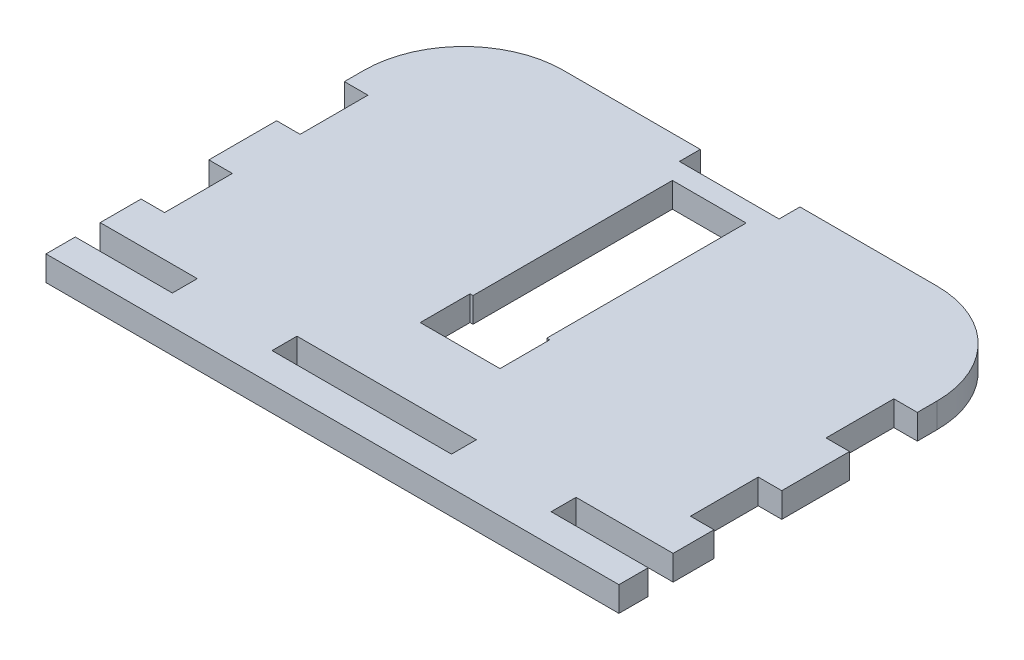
ISO-10303-21;
HEADER;
FILE_DESCRIPTION(('STEP AP214'),'2;1');
FILE_NAME('part.step','',(''),(''),'','','');
FILE_SCHEMA(('AUTOMOTIVE_DESIGN { 1 0 10303 214 1 1 1 1 }'));
ENDSEC;
DATA;
#1=APPLICATION_CONTEXT('core data for automotive mechanical design processes');
#2=APPLICATION_PROTOCOL_DEFINITION('international standard','automotive_design',2000,#1);
#3=PRODUCT_CONTEXT('',#1,'mechanical');
#4=PRODUCT('Part','Part','',(#3));
#5=PRODUCT_RELATED_PRODUCT_CATEGORY('part','',(#4));
#6=PRODUCT_DEFINITION_FORMATION('','',#4);
#7=PRODUCT_DEFINITION_CONTEXT('part definition',#1,'design');
#8=PRODUCT_DEFINITION('design','',#6,#7);
#9=PRODUCT_DEFINITION_SHAPE('','',#8);
#10=(LENGTH_UNIT() NAMED_UNIT(*) SI_UNIT(.MILLI.,.METRE.));
#11=(NAMED_UNIT(*) PLANE_ANGLE_UNIT() SI_UNIT($,.RADIAN.));
#12=(NAMED_UNIT(*) SI_UNIT($,.STERADIAN.) SOLID_ANGLE_UNIT());
#13=UNCERTAINTY_MEASURE_WITH_UNIT(LENGTH_MEASURE(1.E-05),#10,'distance_accuracy_value','');
#14=(GEOMETRIC_REPRESENTATION_CONTEXT(3) GLOBAL_UNCERTAINTY_ASSIGNED_CONTEXT((#13)) GLOBAL_UNIT_ASSIGNED_CONTEXT((#10,
#11,#12)) REPRESENTATION_CONTEXT('',''));
#15=CARTESIAN_POINT('',(0.,0.,0.));
#16=DIRECTION('',(0.,0.,1.));
#17=DIRECTION('',(1.,0.,0.));
#18=AXIS2_PLACEMENT_3D('',#15,#16,#17);
#19=CARTESIAN_POINT('',(23.8,3.175,-21.7846381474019));
#20=DIRECTION('',(0.,-1.,0.));
#21=DIRECTION('',(0.,0.,-1.));
#22=AXIS2_PLACEMENT_3D('',#19,#20,#21);
#23=PLANE('',#22);
#24=DIRECTION('',(0.,0.,-1.));
#25=VECTOR('',#24,1.);
#26=CARTESIAN_POINT('',(4.69899999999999,3.175,-29.2810115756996));
#27=LINE('',#26,#25);
#28=CARTESIAN_POINT('',(4.69899999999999,3.175,-3.87742834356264));
#29=VERTEX_POINT('',#28);
#30=CARTESIAN_POINT('',(4.69899999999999,3.175,-29.2810115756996));
#31=VERTEX_POINT('',#30);
#32=EDGE_CURVE('E406',#29,#31,#27,.T.);
#33=ORIENTED_EDGE('',*,*,#32,.F.);
#34=DIRECTION('',(-1.,0.,0.));
#35=VECTOR('',#34,1.);
#36=CARTESIAN_POINT('',(5.08,3.175,-3.87742834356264));
#37=LINE('',#36,#35);
#38=CARTESIAN_POINT('',(5.08,3.175,-3.87742834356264));
#39=VERTEX_POINT('',#38);
#40=EDGE_CURVE('E355',#39,#29,#37,.T.);
#41=ORIENTED_EDGE('',*,*,#40,.F.);
#42=DIRECTION('',(0.,0.,-1.));
#43=VECTOR('',#42,1.);
#44=CARTESIAN_POINT('',(5.08,3.175,2.46898842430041));
#45=LINE('',#44,#43);
#46=CARTESIAN_POINT('',(5.08,3.175,2.46898842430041));
#47=VERTEX_POINT('',#46);
#48=EDGE_CURVE('E363',#47,#39,#45,.T.);
#49=ORIENTED_EDGE('',*,*,#48,.F.);
#50=DIRECTION('',(1.,0.,0.));
#51=VECTOR('',#50,1.);
#52=CARTESIAN_POINT('',(-4.69900000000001,3.175,2.46898842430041));
#53=LINE('',#52,#51);
#54=CARTESIAN_POINT('',(-5.08,3.175,2.46898842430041));
#55=VERTEX_POINT('',#54);
#56=EDGE_CURVE('E404',#55,#47,#53,.T.);
#57=ORIENTED_EDGE('',*,*,#56,.F.);
#58=DIRECTION('',(0.,0.,1.));
#59=VECTOR('',#58,1.);
#60=CARTESIAN_POINT('',(-5.08,3.175,2.46898842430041));
#61=LINE('',#60,#59);
#62=CARTESIAN_POINT('',(-5.08,3.175,-3.87742834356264));
#63=VERTEX_POINT('',#62);
#64=EDGE_CURVE('E346',#63,#55,#61,.T.);
#65=ORIENTED_EDGE('',*,*,#64,.F.);
#66=CARTESIAN_POINT('',(-4.69900000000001,3.175,-3.87742834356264));
#67=VERTEX_POINT('',#66);
#68=EDGE_CURVE('E358',#67,#63,#37,.T.);
#69=ORIENTED_EDGE('',*,*,#68,.F.);
#70=DIRECTION('',(0.,0.,1.));
#71=VECTOR('',#70,1.);
#72=CARTESIAN_POINT('',(-4.69900000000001,3.175,-29.2810115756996));
#73=LINE('',#72,#71);
#74=CARTESIAN_POINT('',(-4.69900000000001,3.175,-29.2810115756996));
#75=VERTEX_POINT('',#74);
#76=EDGE_CURVE('E401',#75,#67,#73,.T.);
#77=ORIENTED_EDGE('',*,*,#76,.F.);
#78=DIRECTION('',(-1.,0.,0.));
#79=VECTOR('',#78,1.);
#80=CARTESIAN_POINT('',(0.,3.175,-29.2810115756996));
#81=LINE('',#80,#79);
#82=EDGE_CURVE('E399',#31,#75,#81,.T.);
#83=ORIENTED_EDGE('',*,*,#82,.F.);
#84=EDGE_LOOP('',(#33,#41,#49,#57,#65,#69,#77,#83));
#85=FACE_BOUND('',#84,.T.);
#86=DIRECTION('',(1.,0.,0.));
#87=VECTOR('',#86,1.);
#88=CARTESIAN_POINT('',(33.5028,3.175,-19.29));
#89=LINE('',#88,#87);
#90=CARTESIAN_POINT('',(33.5028,3.175,-19.29));
#91=VERTEX_POINT('',#90);
#92=CARTESIAN_POINT('',(36.5,3.175,-19.29));
#93=VERTEX_POINT('',#92);
#94=EDGE_CURVE('E418',#91,#93,#89,.T.);
#95=ORIENTED_EDGE('',*,*,#94,.T.);
#96=DIRECTION('',(0.,0.,-1.));
#97=VECTOR('',#96,1.);
#98=CARTESIAN_POINT('',(36.5,3.175,-19.29));
#99=LINE('',#98,#97);
#100=CARTESIAN_POINT('',(36.5,3.175,-21.7846381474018));
#101=VERTEX_POINT('',#100);
#102=EDGE_CURVE('E421',#93,#101,#99,.T.);
#103=ORIENTED_EDGE('',*,*,#102,.T.);
#104=CARTESIAN_POINT('',(23.8,3.175,-21.7846381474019));
#105=DIRECTION('',(0.,1.,0.));
#106=DIRECTION('',(0.,0.,-1.));
#107=AXIS2_PLACEMENT_3D('',#104,#105,#106);
#108=CIRCLE('',#107,12.7);
#109=CARTESIAN_POINT('',(23.7999999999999,3.175,-34.4846381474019));
#110=VERTEX_POINT('',#109);
#111=EDGE_CURVE('E424',#101,#110,#108,.T.);
#112=ORIENTED_EDGE('',*,*,#111,.T.);
#113=DIRECTION('',(-1.,0.,0.));
#114=VECTOR('',#113,1.);
#115=CARTESIAN_POINT('',(6.34999999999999,3.175,-34.4846381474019));
#116=LINE('',#115,#114);
#117=CARTESIAN_POINT('',(6.34999999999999,3.175,-34.4846381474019));
#118=VERTEX_POINT('',#117);
#119=EDGE_CURVE('E426',#110,#118,#116,.T.);
#120=ORIENTED_EDGE('',*,*,#119,.T.);
#121=DIRECTION('',(0.,0.,1.));
#122=VECTOR('',#121,1.);
#123=CARTESIAN_POINT('',(6.34999999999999,3.175,-34.4846381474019));
#124=LINE('',#123,#122);
#125=CARTESIAN_POINT('',(6.34999999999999,3.175,-31.8210115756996));
#126=VERTEX_POINT('',#125);
#127=EDGE_CURVE('E428',#118,#126,#124,.T.);
#128=ORIENTED_EDGE('',*,*,#127,.T.);
#129=DIRECTION('',(-1.,0.,0.));
#130=VECTOR('',#129,1.);
#131=CARTESIAN_POINT('',(0.,3.175,-31.8210115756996));
#132=LINE('',#131,#130);
#133=CARTESIAN_POINT('',(-6.35000000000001,3.175,-31.8210115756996));
#134=VERTEX_POINT('',#133);
#135=EDGE_CURVE('E430',#126,#134,#132,.T.);
#136=ORIENTED_EDGE('',*,*,#135,.T.);
#137=DIRECTION('',(0.,0.,-1.));
#138=VECTOR('',#137,1.);
#139=CARTESIAN_POINT('',(-6.35000000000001,3.175,-34.4846381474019));
#140=LINE('',#139,#138);
#141=CARTESIAN_POINT('',(-6.35000000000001,3.175,-34.4846381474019));
#142=VERTEX_POINT('',#141);
#143=EDGE_CURVE('E432',#134,#142,#140,.T.);
#144=ORIENTED_EDGE('',*,*,#143,.T.);
#145=DIRECTION('',(-1.,0.,0.));
#146=VECTOR('',#145,1.);
#147=CARTESIAN_POINT('',(-6.35000000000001,3.175,-34.4846381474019));
#148=LINE('',#147,#146);
#149=CARTESIAN_POINT('',(-23.7999999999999,3.175,-34.4846381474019));
#150=VERTEX_POINT('',#149);
#151=EDGE_CURVE('E434',#142,#150,#148,.T.);
#152=ORIENTED_EDGE('',*,*,#151,.T.);
#153=CARTESIAN_POINT('',(-23.8,3.175,-21.7846381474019));
#154=DIRECTION('',(0.,1.,0.));
#155=DIRECTION('',(0.,0.,1.));
#156=AXIS2_PLACEMENT_3D('',#153,#154,#155);
#157=CIRCLE('',#156,12.7);
#158=CARTESIAN_POINT('',(-36.5,3.175,-21.7846381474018));
#159=VERTEX_POINT('',#158);
#160=EDGE_CURVE('E436',#150,#159,#157,.T.);
#161=ORIENTED_EDGE('',*,*,#160,.T.);
#162=DIRECTION('',(0.,0.,1.));
#163=VECTOR('',#162,1.);
#164=CARTESIAN_POINT('',(-36.5,3.175,-19.29));
#165=LINE('',#164,#163);
#166=CARTESIAN_POINT('',(-36.5,3.175,-19.29));
#167=VERTEX_POINT('',#166);
#168=EDGE_CURVE('E438',#159,#167,#165,.T.);
#169=ORIENTED_EDGE('',*,*,#168,.T.);
#170=DIRECTION('',(1.,0.,0.));
#171=VECTOR('',#170,1.);
#172=CARTESIAN_POINT('',(-33.5028,3.175,-19.29));
#173=LINE('',#172,#171);
#174=CARTESIAN_POINT('',(-33.5028,3.175,-19.29));
#175=VERTEX_POINT('',#174);
#176=EDGE_CURVE('E440',#167,#175,#173,.T.);
#177=ORIENTED_EDGE('',*,*,#176,.T.);
#178=DIRECTION('',(0.,0.,1.));
#179=VECTOR('',#178,1.);
#180=CARTESIAN_POINT('',(-33.5028,3.175,-10.654));
#181=LINE('',#180,#179);
#182=CARTESIAN_POINT('',(-33.5028,3.175,-10.654));
#183=VERTEX_POINT('',#182);
#184=EDGE_CURVE('E442',#175,#183,#181,.T.);
#185=ORIENTED_EDGE('',*,*,#184,.T.);
#186=DIRECTION('',(-1.,0.,0.));
#187=VECTOR('',#186,1.);
#188=CARTESIAN_POINT('',(-36.5,3.175,-10.654));
#189=LINE('',#188,#187);
#190=CARTESIAN_POINT('',(-36.5,3.175,-10.654));
#191=VERTEX_POINT('',#190);
#192=EDGE_CURVE('E444',#183,#191,#189,.T.);
#193=ORIENTED_EDGE('',*,*,#192,.T.);
#194=DIRECTION('',(0.,0.,1.));
#195=VECTOR('',#194,1.);
#196=CARTESIAN_POINT('',(-36.5,3.175,-2.018));
#197=LINE('',#196,#195);
#198=CARTESIAN_POINT('',(-36.5,3.175,-2.018));
#199=VERTEX_POINT('',#198);
#200=EDGE_CURVE('E446',#191,#199,#197,.T.);
#201=ORIENTED_EDGE('',*,*,#200,.T.);
#202=DIRECTION('',(1.,0.,0.));
#203=VECTOR('',#202,1.);
#204=CARTESIAN_POINT('',(-36.5,3.175,-2.018));
#205=LINE('',#204,#203);
#206=CARTESIAN_POINT('',(-33.5028,3.175,-2.018));
#207=VERTEX_POINT('',#206);
#208=EDGE_CURVE('E448',#199,#207,#205,.T.);
#209=ORIENTED_EDGE('',*,*,#208,.T.);
#210=DIRECTION('',(0.,0.,1.));
#211=VECTOR('',#210,1.);
#212=CARTESIAN_POINT('',(-33.5028,3.175,6.61799999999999));
#213=LINE('',#212,#211);
#214=CARTESIAN_POINT('',(-33.5028,3.175,6.61799999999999));
#215=VERTEX_POINT('',#214);
#216=EDGE_CURVE('E450',#207,#215,#213,.T.);
#217=ORIENTED_EDGE('',*,*,#216,.T.);
#218=DIRECTION('',(-1.,0.,0.));
#219=VECTOR('',#218,1.);
#220=CARTESIAN_POINT('',(-36.5,3.175,6.61799999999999));
#221=LINE('',#220,#219);
#222=CARTESIAN_POINT('',(-36.5,3.175,6.61799999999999));
#223=VERTEX_POINT('',#222);
#224=EDGE_CURVE('E452',#215,#223,#221,.T.);
#225=ORIENTED_EDGE('',*,*,#224,.T.);
#226=DIRECTION('',(0.,0.,1.));
#227=VECTOR('',#226,1.);
#228=CARTESIAN_POINT('',(-36.5,3.175,11.825));
#229=LINE('',#228,#227);
#230=CARTESIAN_POINT('',(-36.5,3.175,11.825));
#231=VERTEX_POINT('',#230);
#232=EDGE_CURVE('E454',#223,#231,#229,.T.);
#233=ORIENTED_EDGE('',*,*,#232,.T.);
#234=DIRECTION('',(1.,0.,0.));
#235=VECTOR('',#234,1.);
#236=CARTESIAN_POINT('',(-33.5028,3.175,11.825));
#237=LINE('',#236,#235);
#238=CARTESIAN_POINT('',(-24.13,3.175,11.825));
#239=VERTEX_POINT('',#238);
#240=EDGE_CURVE('E456',#231,#239,#237,.T.);
#241=ORIENTED_EDGE('',*,*,#240,.T.);
#242=DIRECTION('',(0.,0.,1.));
#243=VECTOR('',#242,1.);
#244=CARTESIAN_POINT('',(-24.13,3.175,15.));
#245=LINE('',#244,#243);
#246=CARTESIAN_POINT('',(-24.13,3.175,15.));
#247=VERTEX_POINT('',#246);
#248=EDGE_CURVE('E458',#239,#247,#245,.T.);
#249=ORIENTED_EDGE('',*,*,#248,.T.);
#250=DIRECTION('',(-1.,0.,0.));
#251=VECTOR('',#250,1.);
#252=CARTESIAN_POINT('',(-24.13,3.175,15.));
#253=LINE('',#252,#251);
#254=CARTESIAN_POINT('',(-36.5,3.175,15.));
#255=VERTEX_POINT('',#254);
#256=EDGE_CURVE('E460',#247,#255,#253,.T.);
#257=ORIENTED_EDGE('',*,*,#256,.T.);
#258=DIRECTION('',(0.,0.,1.));
#259=VECTOR('',#258,1.);
#260=CARTESIAN_POINT('',(-36.5,3.175,15.));
#261=LINE('',#260,#259);
#262=CARTESIAN_POINT('',(-36.5,3.175,18.7309149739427));
#263=VERTEX_POINT('',#262);
#264=EDGE_CURVE('E462',#255,#263,#261,.T.);
#265=ORIENTED_EDGE('',*,*,#264,.T.);
#266=DIRECTION('',(1.,0.,0.));
#267=VECTOR('',#266,1.);
#268=CARTESIAN_POINT('',(-36.5,3.175,18.7309149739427));
#269=LINE('',#268,#267);
#270=CARTESIAN_POINT('',(36.5,3.175,18.7309149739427));
#271=VERTEX_POINT('',#270);
#272=EDGE_CURVE('E464',#263,#271,#269,.T.);
#273=ORIENTED_EDGE('',*,*,#272,.T.);
#274=DIRECTION('',(0.,0.,-1.));
#275=VECTOR('',#274,1.);
#276=CARTESIAN_POINT('',(36.5,3.175,18.7309149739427));
#277=LINE('',#276,#275);
#278=CARTESIAN_POINT('',(36.5,3.175,15.));
#279=VERTEX_POINT('',#278);
#280=EDGE_CURVE('E466',#271,#279,#277,.T.);
#281=ORIENTED_EDGE('',*,*,#280,.T.);
#282=DIRECTION('',(-1.,0.,0.));
#283=VECTOR('',#282,1.);
#284=CARTESIAN_POINT('',(36.5,3.175,15.));
#285=LINE('',#284,#283);
#286=CARTESIAN_POINT('',(24.13,3.175,15.));
#287=VERTEX_POINT('',#286);
#288=EDGE_CURVE('E468',#279,#287,#285,.T.);
#289=ORIENTED_EDGE('',*,*,#288,.T.);
#290=DIRECTION('',(0.,0.,-1.));
#291=VECTOR('',#290,1.);
#292=CARTESIAN_POINT('',(24.13,3.175,15.));
#293=LINE('',#292,#291);
#294=CARTESIAN_POINT('',(24.13,3.175,11.825));
#295=VERTEX_POINT('',#294);
#296=EDGE_CURVE('E470',#287,#295,#293,.T.);
#297=ORIENTED_EDGE('',*,*,#296,.T.);
#298=DIRECTION('',(1.,0.,0.));
#299=VECTOR('',#298,1.);
#300=CARTESIAN_POINT('',(24.13,3.175,11.825));
#301=LINE('',#300,#299);
#302=CARTESIAN_POINT('',(36.5,3.175,11.825));
#303=VERTEX_POINT('',#302);
#304=EDGE_CURVE('E472',#295,#303,#301,.T.);
#305=ORIENTED_EDGE('',*,*,#304,.T.);
#306=DIRECTION('',(0.,0.,-1.));
#307=VECTOR('',#306,1.);
#308=CARTESIAN_POINT('',(36.5,3.175,11.825));
#309=LINE('',#308,#307);
#310=CARTESIAN_POINT('',(36.5,3.175,6.61799999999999));
#311=VERTEX_POINT('',#310);
#312=EDGE_CURVE('E474',#303,#311,#309,.T.);
#313=ORIENTED_EDGE('',*,*,#312,.T.);
#314=DIRECTION('',(-1.,0.,0.));
#315=VECTOR('',#314,1.);
#316=CARTESIAN_POINT('',(36.5,3.175,6.61799999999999));
#317=LINE('',#316,#315);
#318=CARTESIAN_POINT('',(33.5028,3.175,6.61799999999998));
#319=VERTEX_POINT('',#318);
#320=EDGE_CURVE('E476',#311,#319,#317,.T.);
#321=ORIENTED_EDGE('',*,*,#320,.T.);
#322=DIRECTION('',(0.,0.,-1.));
#323=VECTOR('',#322,1.);
#324=CARTESIAN_POINT('',(33.5028,3.175,6.61799999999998));
#325=LINE('',#324,#323);
#326=CARTESIAN_POINT('',(33.5028,3.175,-2.01800000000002));
#327=VERTEX_POINT('',#326);
#328=EDGE_CURVE('E478',#319,#327,#325,.T.);
#329=ORIENTED_EDGE('',*,*,#328,.T.);
#330=DIRECTION('',(1.,0.,0.));
#331=VECTOR('',#330,1.);
#332=CARTESIAN_POINT('',(36.5,3.175,-2.01800000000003));
#333=LINE('',#332,#331);
#334=CARTESIAN_POINT('',(36.5,3.175,-2.01800000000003));
#335=VERTEX_POINT('',#334);
#336=EDGE_CURVE('E480',#327,#335,#333,.T.);
#337=ORIENTED_EDGE('',*,*,#336,.T.);
#338=DIRECTION('',(0.,0.,-1.));
#339=VECTOR('',#338,1.);
#340=CARTESIAN_POINT('',(36.5,3.175,-2.01800000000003));
#341=LINE('',#340,#339);
#342=CARTESIAN_POINT('',(36.5,3.175,-10.654));
#343=VERTEX_POINT('',#342);
#344=EDGE_CURVE('E482',#335,#343,#341,.T.);
#345=ORIENTED_EDGE('',*,*,#344,.T.);
#346=DIRECTION('',(-1.,0.,0.));
#347=VECTOR('',#346,1.);
#348=CARTESIAN_POINT('',(36.5,3.175,-10.654));
#349=LINE('',#348,#347);
#350=CARTESIAN_POINT('',(33.5028,3.175,-10.654));
#351=VERTEX_POINT('',#350);
#352=EDGE_CURVE('E484',#343,#351,#349,.T.);
#353=ORIENTED_EDGE('',*,*,#352,.T.);
#354=DIRECTION('',(0.,0.,-1.));
#355=VECTOR('',#354,1.);
#356=CARTESIAN_POINT('',(33.5028,3.175,-10.654));
#357=LINE('',#356,#355);
#358=EDGE_CURVE('E486',#351,#91,#357,.T.);
#359=ORIENTED_EDGE('',*,*,#358,.T.);
#360=EDGE_LOOP('',(#95,#103,#112,#120,#128,#136,#144,#152,#161,#169,#177,#185,#193,#201,#209,
#217,#225,#233,#241,#249,#257,#265,#273,#281,#289,#297,#305,#313,#321,#329,#337,#345,#353,#359));
#361=FACE_BOUND('',#360,.T.);
#362=DIRECTION('',(0.,0.,1.));
#363=VECTOR('',#362,1.);
#364=CARTESIAN_POINT('',(-11.43,3.175,11.825));
#365=LINE('',#364,#363);
#366=CARTESIAN_POINT('',(-11.43,3.175,11.825));
#367=VERTEX_POINT('',#366);
#368=CARTESIAN_POINT('',(-11.43,3.175,15.));
#369=VERTEX_POINT('',#368);
#370=EDGE_CURVE('E373',#367,#369,#365,.T.);
#371=ORIENTED_EDGE('',*,*,#370,.F.);
#372=DIRECTION('',(-1.,0.,0.));
#373=VECTOR('',#372,1.);
#374=CARTESIAN_POINT('',(-11.43,3.175,11.825));
#375=LINE('',#374,#373);
#376=CARTESIAN_POINT('',(11.43,3.175,11.825));
#377=VERTEX_POINT('',#376);
#378=EDGE_CURVE('E380',#377,#367,#375,.T.);
#379=ORIENTED_EDGE('',*,*,#378,.F.);
#380=DIRECTION('',(0.,0.,-1.));
#381=VECTOR('',#380,1.);
#382=CARTESIAN_POINT('',(11.43,3.175,11.825));
#383=LINE('',#382,#381);
#384=CARTESIAN_POINT('',(11.43,3.175,15.));
#385=VERTEX_POINT('',#384);
#386=EDGE_CURVE('E378',#385,#377,#383,.T.);
#387=ORIENTED_EDGE('',*,*,#386,.F.);
#388=DIRECTION('',(1.,0.,0.));
#389=VECTOR('',#388,1.);
#390=CARTESIAN_POINT('',(-11.43,3.175,15.));
#391=LINE('',#390,#389);
#392=EDGE_CURVE('E375',#369,#385,#391,.T.);
#393=ORIENTED_EDGE('',*,*,#392,.F.);
#394=EDGE_LOOP('',(#371,#379,#387,#393));
#395=FACE_BOUND('',#394,.T.);
#396=ADVANCED_FACE('F31',(#85,#361,#395),#23,.F.);
#397=CARTESIAN_POINT('',(23.8,0.,-21.7846381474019));
#398=DIRECTION('',(0.,-1.,0.));
#399=DIRECTION('',(0.,0.,-1.));
#400=AXIS2_PLACEMENT_3D('',#397,#398,#399);
#401=PLANE('',#400);
#402=DIRECTION('',(-1.,0.,0.));
#403=VECTOR('',#402,1.);
#404=CARTESIAN_POINT('',(5.08,0.,-3.87742834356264));
#405=LINE('',#404,#403);
#406=CARTESIAN_POINT('',(5.08,0.,-3.87742834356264));
#407=VERTEX_POINT('',#406);
#408=CARTESIAN_POINT('',(4.69899999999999,0.,-3.87742834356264));
#409=VERTEX_POINT('',#408);
#410=EDGE_CURVE('E347',#407,#409,#405,.T.);
#411=ORIENTED_EDGE('',*,*,#410,.T.);
#412=DIRECTION('',(0.,0.,-1.));
#413=VECTOR('',#412,1.);
#414=CARTESIAN_POINT('',(4.69899999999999,0.,-29.2810115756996));
#415=LINE('',#414,#413);
#416=CARTESIAN_POINT('',(4.69899999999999,0.,-29.2810115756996));
#417=VERTEX_POINT('',#416);
#418=EDGE_CURVE('E336',#409,#417,#415,.T.);
#419=ORIENTED_EDGE('',*,*,#418,.T.);
#420=DIRECTION('',(-1.,0.,0.));
#421=VECTOR('',#420,1.);
#422=CARTESIAN_POINT('',(0.,0.,-29.2810115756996));
#423=LINE('',#422,#421);
#424=CARTESIAN_POINT('',(-4.69900000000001,0.,-29.2810115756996));
#425=VERTEX_POINT('',#424);
#426=EDGE_CURVE('E398',#417,#425,#423,.T.);
#427=ORIENTED_EDGE('',*,*,#426,.T.);
#428=DIRECTION('',(0.,0.,1.));
#429=VECTOR('',#428,1.);
#430=CARTESIAN_POINT('',(-4.69900000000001,0.,-29.2810115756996));
#431=LINE('',#430,#429);
#432=CARTESIAN_POINT('',(-4.69900000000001,0.,-3.87742834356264));
#433=VERTEX_POINT('',#432);
#434=EDGE_CURVE('E337',#425,#433,#431,.T.);
#435=ORIENTED_EDGE('',*,*,#434,.T.);
#436=CARTESIAN_POINT('',(-5.08,0.,-3.87742834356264));
#437=VERTEX_POINT('',#436);
#438=EDGE_CURVE('E353',#433,#437,#405,.T.);
#439=ORIENTED_EDGE('',*,*,#438,.T.);
#440=DIRECTION('',(0.,0.,1.));
#441=VECTOR('',#440,1.);
#442=CARTESIAN_POINT('',(-5.08,0.,2.46898842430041));
#443=LINE('',#442,#441);
#444=CARTESIAN_POINT('',(-5.08,0.,2.46898842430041));
#445=VERTEX_POINT('',#444);
#446=EDGE_CURVE('E343',#437,#445,#443,.T.);
#447=ORIENTED_EDGE('',*,*,#446,.T.);
#448=DIRECTION('',(1.,0.,0.));
#449=VECTOR('',#448,1.);
#450=CARTESIAN_POINT('',(-4.69900000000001,0.,2.46898842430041));
#451=LINE('',#450,#449);
#452=CARTESIAN_POINT('',(5.08,0.,2.46898842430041));
#453=VERTEX_POINT('',#452);
#454=EDGE_CURVE('E325',#445,#453,#451,.T.);
#455=ORIENTED_EDGE('',*,*,#454,.T.);
#456=DIRECTION('',(0.,0.,-1.));
#457=VECTOR('',#456,1.);
#458=CARTESIAN_POINT('',(5.08,0.,2.46898842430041));
#459=LINE('',#458,#457);
#460=EDGE_CURVE('E354',#453,#407,#459,.T.);
#461=ORIENTED_EDGE('',*,*,#460,.T.);
#462=EDGE_LOOP('',(#411,#419,#427,#435,#439,#447,#455,#461));
#463=FACE_BOUND('',#462,.T.);
#464=DIRECTION('',(1.,0.,0.));
#465=VECTOR('',#464,1.);
#466=CARTESIAN_POINT('',(33.5028,0.,-19.29));
#467=LINE('',#466,#465);
#468=CARTESIAN_POINT('',(33.5028,0.,-19.29));
#469=VERTEX_POINT('',#468);
#470=CARTESIAN_POINT('',(36.5,0.,-19.29));
#471=VERTEX_POINT('',#470);
#472=EDGE_CURVE('E417',#469,#471,#467,.T.);
#473=ORIENTED_EDGE('',*,*,#472,.F.);
#474=DIRECTION('',(0.,0.,-1.));
#475=VECTOR('',#474,1.);
#476=CARTESIAN_POINT('',(33.5028,0.,-10.654));
#477=LINE('',#476,#475);
#478=CARTESIAN_POINT('',(33.5028,0.,-10.654));
#479=VERTEX_POINT('',#478);
#480=EDGE_CURVE('E422',#479,#469,#477,.T.);
#481=ORIENTED_EDGE('',*,*,#480,.F.);
#482=DIRECTION('',(-1.,0.,0.));
#483=VECTOR('',#482,1.);
#484=CARTESIAN_POINT('',(36.5,0.,-10.654));
#485=LINE('',#484,#483);
#486=CARTESIAN_POINT('',(36.5,0.,-10.654));
#487=VERTEX_POINT('',#486);
#488=EDGE_CURVE('E556',#487,#479,#485,.T.);
#489=ORIENTED_EDGE('',*,*,#488,.F.);
#490=DIRECTION('',(0.,0.,-1.));
#491=VECTOR('',#490,1.);
#492=CARTESIAN_POINT('',(36.5,0.,-2.01800000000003));
#493=LINE('',#492,#491);
#494=CARTESIAN_POINT('',(36.5,0.,-2.01800000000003));
#495=VERTEX_POINT('',#494);
#496=EDGE_CURVE('E554',#495,#487,#493,.T.);
#497=ORIENTED_EDGE('',*,*,#496,.F.);
#498=DIRECTION('',(1.,0.,0.));
#499=VECTOR('',#498,1.);
#500=CARTESIAN_POINT('',(36.5,0.,-2.01800000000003));
#501=LINE('',#500,#499);
#502=CARTESIAN_POINT('',(33.5028,0.,-2.01800000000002));
#503=VERTEX_POINT('',#502);
#504=EDGE_CURVE('E552',#503,#495,#501,.T.);
#505=ORIENTED_EDGE('',*,*,#504,.F.);
#506=DIRECTION('',(0.,0.,-1.));
#507=VECTOR('',#506,1.);
#508=CARTESIAN_POINT('',(33.5028,0.,6.61799999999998));
#509=LINE('',#508,#507);
#510=CARTESIAN_POINT('',(33.5028,0.,6.61799999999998));
#511=VERTEX_POINT('',#510);
#512=EDGE_CURVE('E550',#511,#503,#509,.T.);
#513=ORIENTED_EDGE('',*,*,#512,.F.);
#514=DIRECTION('',(-1.,0.,0.));
#515=VECTOR('',#514,1.);
#516=CARTESIAN_POINT('',(36.5,0.,6.61799999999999));
#517=LINE('',#516,#515);
#518=CARTESIAN_POINT('',(36.5,0.,6.61799999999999));
#519=VERTEX_POINT('',#518);
#520=EDGE_CURVE('E548',#519,#511,#517,.T.);
#521=ORIENTED_EDGE('',*,*,#520,.F.);
#522=DIRECTION('',(0.,0.,-1.));
#523=VECTOR('',#522,1.);
#524=CARTESIAN_POINT('',(36.5,0.,11.825));
#525=LINE('',#524,#523);
#526=CARTESIAN_POINT('',(36.5,0.,11.825));
#527=VERTEX_POINT('',#526);
#528=EDGE_CURVE('E546',#527,#519,#525,.T.);
#529=ORIENTED_EDGE('',*,*,#528,.F.);
#530=DIRECTION('',(1.,0.,0.));
#531=VECTOR('',#530,1.);
#532=CARTESIAN_POINT('',(33.5028,0.,11.825));
#533=LINE('',#532,#531);
#534=CARTESIAN_POINT('',(24.13,0.,11.825));
#535=VERTEX_POINT('',#534);
#536=EDGE_CURVE('E544',#535,#527,#533,.T.);
#537=ORIENTED_EDGE('',*,*,#536,.F.);
#538=DIRECTION('',(0.,0.,-1.));
#539=VECTOR('',#538,1.);
#540=CARTESIAN_POINT('',(24.13,0.,15.));
#541=LINE('',#540,#539);
#542=CARTESIAN_POINT('',(24.13,0.,15.));
#543=VERTEX_POINT('',#542);
#544=EDGE_CURVE('E541',#543,#535,#541,.T.);
#545=ORIENTED_EDGE('',*,*,#544,.F.);
#546=DIRECTION('',(-1.,0.,0.));
#547=VECTOR('',#546,1.);
#548=CARTESIAN_POINT('',(36.5,0.,15.));
#549=LINE('',#548,#547);
#550=CARTESIAN_POINT('',(36.5,0.,15.));
#551=VERTEX_POINT('',#550);
#552=EDGE_CURVE('E539',#551,#543,#549,.T.);
#553=ORIENTED_EDGE('',*,*,#552,.F.);
#554=DIRECTION('',(0.,0.,-1.));
#555=VECTOR('',#554,1.);
#556=CARTESIAN_POINT('',(36.5,0.,18.7309149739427));
#557=LINE('',#556,#555);
#558=CARTESIAN_POINT('',(36.5,0.,18.7309149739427));
#559=VERTEX_POINT('',#558);
#560=EDGE_CURVE('E537',#559,#551,#557,.T.);
#561=ORIENTED_EDGE('',*,*,#560,.F.);
#562=DIRECTION('',(1.,0.,0.));
#563=VECTOR('',#562,1.);
#564=CARTESIAN_POINT('',(-36.5,0.,18.7309149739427));
#565=LINE('',#564,#563);
#566=CARTESIAN_POINT('',(-36.5,0.,18.7309149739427));
#567=VERTEX_POINT('',#566);
#568=EDGE_CURVE('E535',#567,#559,#565,.T.);
#569=ORIENTED_EDGE('',*,*,#568,.F.);
#570=DIRECTION('',(0.,0.,1.));
#571=VECTOR('',#570,1.);
#572=CARTESIAN_POINT('',(-36.5,0.,15.));
#573=LINE('',#572,#571);
#574=CARTESIAN_POINT('',(-36.5,0.,15.));
#575=VERTEX_POINT('',#574);
#576=EDGE_CURVE('E533',#575,#567,#573,.T.);
#577=ORIENTED_EDGE('',*,*,#576,.F.);
#578=DIRECTION('',(-1.,0.,0.));
#579=VECTOR('',#578,1.);
#580=CARTESIAN_POINT('',(-24.13,0.,15.));
#581=LINE('',#580,#579);
#582=CARTESIAN_POINT('',(-24.13,0.,15.));
#583=VERTEX_POINT('',#582);
#584=EDGE_CURVE('E531',#583,#575,#581,.T.);
#585=ORIENTED_EDGE('',*,*,#584,.F.);
#586=DIRECTION('',(0.,0.,1.));
#587=VECTOR('',#586,1.);
#588=CARTESIAN_POINT('',(-24.13,0.,15.));
#589=LINE('',#588,#587);
#590=CARTESIAN_POINT('',(-24.13,0.,11.825));
#591=VERTEX_POINT('',#590);
#592=EDGE_CURVE('E529',#591,#583,#589,.T.);
#593=ORIENTED_EDGE('',*,*,#592,.F.);
#594=DIRECTION('',(1.,0.,0.));
#595=VECTOR('',#594,1.);
#596=CARTESIAN_POINT('',(-24.13,0.,11.825));
#597=LINE('',#596,#595);
#598=CARTESIAN_POINT('',(-36.5,0.,11.825));
#599=VERTEX_POINT('',#598);
#600=EDGE_CURVE('E527',#599,#591,#597,.T.);
#601=ORIENTED_EDGE('',*,*,#600,.F.);
#602=DIRECTION('',(0.,0.,1.));
#603=VECTOR('',#602,1.);
#604=CARTESIAN_POINT('',(-36.5,0.,11.825));
#605=LINE('',#604,#603);
#606=CARTESIAN_POINT('',(-36.5,0.,6.61799999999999));
#607=VERTEX_POINT('',#606);
#608=EDGE_CURVE('E524',#607,#599,#605,.T.);
#609=ORIENTED_EDGE('',*,*,#608,.F.);
#610=DIRECTION('',(-1.,0.,0.));
#611=VECTOR('',#610,1.);
#612=CARTESIAN_POINT('',(-36.5,0.,6.61799999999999));
#613=LINE('',#612,#611);
#614=CARTESIAN_POINT('',(-33.5028,0.,6.61799999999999));
#615=VERTEX_POINT('',#614);
#616=EDGE_CURVE('E522',#615,#607,#613,.T.);
#617=ORIENTED_EDGE('',*,*,#616,.F.);
#618=DIRECTION('',(0.,0.,1.));
#619=VECTOR('',#618,1.);
#620=CARTESIAN_POINT('',(-33.5028,0.,6.61799999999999));
#621=LINE('',#620,#619);
#622=CARTESIAN_POINT('',(-33.5028,0.,-2.018));
#623=VERTEX_POINT('',#622);
#624=EDGE_CURVE('E520',#623,#615,#621,.T.);
#625=ORIENTED_EDGE('',*,*,#624,.F.);
#626=DIRECTION('',(1.,0.,0.));
#627=VECTOR('',#626,1.);
#628=CARTESIAN_POINT('',(-36.5,0.,-2.018));
#629=LINE('',#628,#627);
#630=CARTESIAN_POINT('',(-36.5,0.,-2.018));
#631=VERTEX_POINT('',#630);
#632=EDGE_CURVE('E518',#631,#623,#629,.T.);
#633=ORIENTED_EDGE('',*,*,#632,.F.);
#634=DIRECTION('',(0.,0.,1.));
#635=VECTOR('',#634,1.);
#636=CARTESIAN_POINT('',(-36.5,0.,-2.018));
#637=LINE('',#636,#635);
#638=CARTESIAN_POINT('',(-36.5,0.,-10.654));
#639=VERTEX_POINT('',#638);
#640=EDGE_CURVE('E516',#639,#631,#637,.T.);
#641=ORIENTED_EDGE('',*,*,#640,.F.);
#642=DIRECTION('',(-1.,0.,0.));
#643=VECTOR('',#642,1.);
#644=CARTESIAN_POINT('',(-36.5,0.,-10.654));
#645=LINE('',#644,#643);
#646=CARTESIAN_POINT('',(-33.5028,0.,-10.654));
#647=VERTEX_POINT('',#646);
#648=EDGE_CURVE('E514',#647,#639,#645,.T.);
#649=ORIENTED_EDGE('',*,*,#648,.F.);
#650=DIRECTION('',(0.,0.,1.));
#651=VECTOR('',#650,1.);
#652=CARTESIAN_POINT('',(-33.5028,0.,-10.654));
#653=LINE('',#652,#651);
#654=CARTESIAN_POINT('',(-33.5028,0.,-19.29));
#655=VERTEX_POINT('',#654);
#656=EDGE_CURVE('E512',#655,#647,#653,.T.);
#657=ORIENTED_EDGE('',*,*,#656,.F.);
#658=DIRECTION('',(1.,0.,0.));
#659=VECTOR('',#658,1.);
#660=CARTESIAN_POINT('',(-33.5028,0.,-19.29));
#661=LINE('',#660,#659);
#662=CARTESIAN_POINT('',(-36.5,0.,-19.29));
#663=VERTEX_POINT('',#662);
#664=EDGE_CURVE('E510',#663,#655,#661,.T.);
#665=ORIENTED_EDGE('',*,*,#664,.F.);
#666=DIRECTION('',(0.,0.,1.));
#667=VECTOR('',#666,1.);
#668=CARTESIAN_POINT('',(-36.5,0.,-19.29));
#669=LINE('',#668,#667);
#670=CARTESIAN_POINT('',(-36.5,0.,-21.7846381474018));
#671=VERTEX_POINT('',#670);
#672=EDGE_CURVE('E508',#671,#663,#669,.T.);
#673=ORIENTED_EDGE('',*,*,#672,.F.);
#674=CARTESIAN_POINT('',(-23.8,0.,-21.7846381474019));
#675=DIRECTION('',(0.,1.,0.));
#676=DIRECTION('',(0.,0.,1.));
#677=AXIS2_PLACEMENT_3D('',#674,#675,#676);
#678=CIRCLE('',#677,12.7);
#679=CARTESIAN_POINT('',(-23.7999999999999,0.,-34.4846381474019));
#680=VERTEX_POINT('',#679);
#681=EDGE_CURVE('E506',#680,#671,#678,.T.);
#682=ORIENTED_EDGE('',*,*,#681,.F.);
#683=DIRECTION('',(-1.,0.,0.));
#684=VECTOR('',#683,1.);
#685=CARTESIAN_POINT('',(-6.35000000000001,0.,-34.4846381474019));
#686=LINE('',#685,#684);
#687=CARTESIAN_POINT('',(-6.35000000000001,0.,-34.4846381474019));
#688=VERTEX_POINT('',#687);
#689=EDGE_CURVE('E504',#688,#680,#686,.T.);
#690=ORIENTED_EDGE('',*,*,#689,.F.);
#691=DIRECTION('',(0.,0.,-1.));
#692=VECTOR('',#691,1.);
#693=CARTESIAN_POINT('',(-6.35000000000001,0.,-34.4846381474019));
#694=LINE('',#693,#692);
#695=CARTESIAN_POINT('',(-6.35000000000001,0.,-31.8210115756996));
#696=VERTEX_POINT('',#695);
#697=EDGE_CURVE('E502',#696,#688,#694,.T.);
#698=ORIENTED_EDGE('',*,*,#697,.F.);
#699=DIRECTION('',(-1.,0.,0.));
#700=VECTOR('',#699,1.);
#701=CARTESIAN_POINT('',(0.,0.,-31.8210115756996));
#702=LINE('',#701,#700);
#703=CARTESIAN_POINT('',(6.34999999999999,0.,-31.8210115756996));
#704=VERTEX_POINT('',#703);
#705=EDGE_CURVE('E500',#704,#696,#702,.T.);
#706=ORIENTED_EDGE('',*,*,#705,.F.);
#707=DIRECTION('',(0.,0.,1.));
#708=VECTOR('',#707,1.);
#709=CARTESIAN_POINT('',(6.34999999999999,0.,-34.4846381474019));
#710=LINE('',#709,#708);
#711=CARTESIAN_POINT('',(6.34999999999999,0.,-34.4846381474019));
#712=VERTEX_POINT('',#711);
#713=EDGE_CURVE('E497',#712,#704,#710,.T.);
#714=ORIENTED_EDGE('',*,*,#713,.F.);
#715=DIRECTION('',(-1.,0.,0.));
#716=VECTOR('',#715,1.);
#717=CARTESIAN_POINT('',(6.34999999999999,0.,-34.4846381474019));
#718=LINE('',#717,#716);
#719=CARTESIAN_POINT('',(23.7999999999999,0.,-34.4846381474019));
#720=VERTEX_POINT('',#719);
#721=EDGE_CURVE('E495',#720,#712,#718,.T.);
#722=ORIENTED_EDGE('',*,*,#721,.F.);
#723=CARTESIAN_POINT('',(23.8,0.,-21.7846381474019));
#724=DIRECTION('',(0.,1.,0.));
#725=DIRECTION('',(0.,0.,-1.));
#726=AXIS2_PLACEMENT_3D('',#723,#724,#725);
#727=CIRCLE('',#726,12.7);
#728=CARTESIAN_POINT('',(36.5,0.,-21.7846381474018));
#729=VERTEX_POINT('',#728);
#730=EDGE_CURVE('E493',#729,#720,#727,.T.);
#731=ORIENTED_EDGE('',*,*,#730,.F.);
#732=DIRECTION('',(0.,0.,-1.));
#733=VECTOR('',#732,1.);
#734=CARTESIAN_POINT('',(36.5,0.,-19.29));
#735=LINE('',#734,#733);
#736=EDGE_CURVE('E491',#471,#729,#735,.T.);
#737=ORIENTED_EDGE('',*,*,#736,.F.);
#738=EDGE_LOOP('',(#473,#481,#489,#497,#505,#513,#521,#529,#537,#545,#553,#561,#569,#577,#585,
#593,#601,#609,#617,#625,#633,#641,#649,#657,#665,#673,#682,#690,#698,#706,#714,#722,#731,#737));
#739=FACE_BOUND('',#738,.T.);
#740=DIRECTION('',(-1.,0.,0.));
#741=VECTOR('',#740,1.);
#742=CARTESIAN_POINT('',(-11.43,0.,11.825));
#743=LINE('',#742,#741);
#744=CARTESIAN_POINT('',(11.43,0.,11.825));
#745=VERTEX_POINT('',#744);
#746=CARTESIAN_POINT('',(-11.43,0.,11.825));
#747=VERTEX_POINT('',#746);
#748=EDGE_CURVE('E376',#745,#747,#743,.T.);
#749=ORIENTED_EDGE('',*,*,#748,.T.);
#750=DIRECTION('',(0.,0.,1.));
#751=VECTOR('',#750,1.);
#752=CARTESIAN_POINT('',(-11.43,0.,11.825));
#753=LINE('',#752,#751);
#754=CARTESIAN_POINT('',(-11.43,0.,15.));
#755=VERTEX_POINT('',#754);
#756=EDGE_CURVE('E54',#747,#755,#753,.T.);
#757=ORIENTED_EDGE('',*,*,#756,.T.);
#758=DIRECTION('',(1.,0.,0.));
#759=VECTOR('',#758,1.);
#760=CARTESIAN_POINT('',(-11.43,0.,15.));
#761=LINE('',#760,#759);
#762=CARTESIAN_POINT('',(11.43,0.,15.));
#763=VERTEX_POINT('',#762);
#764=EDGE_CURVE('E384',#755,#763,#761,.T.);
#765=ORIENTED_EDGE('',*,*,#764,.T.);
#766=DIRECTION('',(0.,0.,-1.));
#767=VECTOR('',#766,1.);
#768=CARTESIAN_POINT('',(11.43,0.,11.825));
#769=LINE('',#768,#767);
#770=EDGE_CURVE('E387',#763,#745,#769,.T.);
#771=ORIENTED_EDGE('',*,*,#770,.T.);
#772=EDGE_LOOP('',(#749,#757,#765,#771));
#773=FACE_BOUND('',#772,.T.);
#774=ADVANCED_FACE('F350',(#463,#739,#773),#401,.T.);
#775=CARTESIAN_POINT('',(33.5028,3.175,-19.29));
#776=DIRECTION('',(0.,0.,-1.));
#777=DIRECTION('',(-1.,0.,0.));
#778=AXIS2_PLACEMENT_3D('',#775,#776,#777);
#779=PLANE('',#778);
#780=ORIENTED_EDGE('',*,*,#472,.T.);
#781=DIRECTION('',(0.,-1.,0.));
#782=VECTOR('',#781,1.);
#783=CARTESIAN_POINT('',(36.5,3.175,-19.29));
#784=LINE('',#783,#782);
#785=EDGE_CURVE('E39',#93,#471,#784,.T.);
#786=ORIENTED_EDGE('',*,*,#785,.F.);
#787=ORIENTED_EDGE('',*,*,#94,.F.);
#788=DIRECTION('',(0.,-1.,0.));
#789=VECTOR('',#788,1.);
#790=CARTESIAN_POINT('',(33.5028,3.175,-19.29));
#791=LINE('',#790,#789);
#792=EDGE_CURVE('E488',#91,#469,#791,.T.);
#793=ORIENTED_EDGE('',*,*,#792,.T.);
#794=EDGE_LOOP('',(#780,#786,#787,#793));
#795=FACE_BOUND('',#794,.T.);
#796=ADVANCED_FACE('F33',(#795),#779,.F.);
#797=CARTESIAN_POINT('',(36.5,3.175,-19.29));
#798=DIRECTION('',(-1.,0.,0.));
#799=DIRECTION('',(0.,0.,1.));
#800=AXIS2_PLACEMENT_3D('',#797,#798,#799);
#801=PLANE('',#800);
#802=ORIENTED_EDGE('',*,*,#736,.T.);
#803=DIRECTION('',(0.,-1.,0.));
#804=VECTOR('',#803,1.);
#805=CARTESIAN_POINT('',(36.5,3.175,-21.7846381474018));
#806=LINE('',#805,#804);
#807=EDGE_CURVE('E654',#101,#729,#806,.T.);
#808=ORIENTED_EDGE('',*,*,#807,.F.);
#809=ORIENTED_EDGE('',*,*,#102,.F.);
#810=ORIENTED_EDGE('',*,*,#785,.T.);
#811=EDGE_LOOP('',(#802,#808,#809,#810));
#812=FACE_BOUND('',#811,.T.);
#813=ADVANCED_FACE('F659',(#812),#801,.F.);
#814=CARTESIAN_POINT('',(23.8,3.175,-21.7846381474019));
#815=DIRECTION('',(0.,-1.,0.));
#816=DIRECTION('',(0.,0.,-1.));
#817=AXIS2_PLACEMENT_3D('',#814,#815,#816);
#818=CYLINDRICAL_SURFACE('',#817,12.7);
#819=ORIENTED_EDGE('',*,*,#730,.T.);
#820=DIRECTION('',(0.,-1.,0.));
#821=VECTOR('',#820,1.);
#822=CARTESIAN_POINT('',(23.7999999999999,3.175,-34.4846381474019));
#823=LINE('',#822,#821);
#824=EDGE_CURVE('E651',#110,#720,#823,.T.);
#825=ORIENTED_EDGE('',*,*,#824,.F.);
#826=ORIENTED_EDGE('',*,*,#111,.F.);
#827=ORIENTED_EDGE('',*,*,#807,.T.);
#828=EDGE_LOOP('',(#819,#825,#826,#827));
#829=FACE_BOUND('',#828,.T.);
#830=ADVANCED_FACE('F673',(#829),#818,.T.);
#831=CARTESIAN_POINT('',(6.34999999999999,3.175,-34.4846381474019));
#832=DIRECTION('',(0.,0.,1.));
#833=DIRECTION('',(1.,0.,0.));
#834=AXIS2_PLACEMENT_3D('',#831,#832,#833);
#835=PLANE('',#834);
#836=ORIENTED_EDGE('',*,*,#721,.T.);
#837=DIRECTION('',(0.,-1.,0.));
#838=VECTOR('',#837,1.);
#839=CARTESIAN_POINT('',(6.34999999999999,3.175,-34.4846381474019));
#840=LINE('',#839,#838);
#841=EDGE_CURVE('E648',#118,#712,#840,.T.);
#842=ORIENTED_EDGE('',*,*,#841,.F.);
#843=ORIENTED_EDGE('',*,*,#119,.F.);
#844=ORIENTED_EDGE('',*,*,#824,.T.);
#845=EDGE_LOOP('',(#836,#842,#843,#844));
#846=FACE_BOUND('',#845,.T.);
#847=ADVANCED_FACE('F677',(#846),#835,.F.);
#848=CARTESIAN_POINT('',(6.34999999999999,3.175,-34.4846381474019));
#849=DIRECTION('',(1.,0.,0.));
#850=DIRECTION('',(0.,0.,-1.));
#851=AXIS2_PLACEMENT_3D('',#848,#849,#850);
#852=PLANE('',#851);
#853=ORIENTED_EDGE('',*,*,#713,.T.);
#854=DIRECTION('',(0.,-1.,0.));
#855=VECTOR('',#854,1.);
#856=CARTESIAN_POINT('',(6.34999999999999,3.175,-31.8210115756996));
#857=LINE('',#856,#855);
#858=EDGE_CURVE('E645',#126,#704,#857,.T.);
#859=ORIENTED_EDGE('',*,*,#858,.F.);
#860=ORIENTED_EDGE('',*,*,#127,.F.);
#861=ORIENTED_EDGE('',*,*,#841,.T.);
#862=EDGE_LOOP('',(#853,#859,#860,#861));
#863=FACE_BOUND('',#862,.T.);
#864=ADVANCED_FACE('F823',(#863),#852,.F.);
#865=CARTESIAN_POINT('',(0.,3.175,-31.8210115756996));
#866=DIRECTION('',(0.,0.,1.));
#867=DIRECTION('',(1.,0.,0.));
#868=AXIS2_PLACEMENT_3D('',#865,#866,#867);
#869=PLANE('',#868);
#870=ORIENTED_EDGE('',*,*,#705,.T.);
#871=DIRECTION('',(0.,-1.,0.));
#872=VECTOR('',#871,1.);
#873=CARTESIAN_POINT('',(-6.35000000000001,3.175,-31.8210115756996));
#874=LINE('',#873,#872);
#875=EDGE_CURVE('E642',#134,#696,#874,.T.);
#876=ORIENTED_EDGE('',*,*,#875,.F.);
#877=ORIENTED_EDGE('',*,*,#135,.F.);
#878=ORIENTED_EDGE('',*,*,#858,.T.);
#879=EDGE_LOOP('',(#870,#876,#877,#878));
#880=FACE_BOUND('',#879,.T.);
#881=ADVANCED_FACE('F821',(#880),#869,.F.);
#882=CARTESIAN_POINT('',(-6.35000000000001,3.175,-34.4846381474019));
#883=DIRECTION('',(-1.,0.,0.));
#884=DIRECTION('',(0.,0.,1.));
#885=AXIS2_PLACEMENT_3D('',#882,#883,#884);
#886=PLANE('',#885);
#887=ORIENTED_EDGE('',*,*,#697,.T.);
#888=DIRECTION('',(0.,-1.,0.));
#889=VECTOR('',#888,1.);
#890=CARTESIAN_POINT('',(-6.35000000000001,3.175,-34.4846381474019));
#891=LINE('',#890,#889);
#892=EDGE_CURVE('E639',#142,#688,#891,.T.);
#893=ORIENTED_EDGE('',*,*,#892,.F.);
#894=ORIENTED_EDGE('',*,*,#143,.F.);
#895=ORIENTED_EDGE('',*,*,#875,.T.);
#896=EDGE_LOOP('',(#887,#893,#894,#895));
#897=FACE_BOUND('',#896,.T.);
#898=ADVANCED_FACE('F816',(#897),#886,.F.);
#899=CARTESIAN_POINT('',(-6.35000000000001,3.175,-34.4846381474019));
#900=DIRECTION('',(0.,0.,1.));
#901=DIRECTION('',(1.,0.,0.));
#902=AXIS2_PLACEMENT_3D('',#899,#900,#901);
#903=PLANE('',#902);
#904=ORIENTED_EDGE('',*,*,#689,.T.);
#905=DIRECTION('',(0.,-1.,0.));
#906=VECTOR('',#905,1.);
#907=CARTESIAN_POINT('',(-23.7999999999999,3.175,-34.4846381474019));
#908=LINE('',#907,#906);
#909=EDGE_CURVE('E636',#150,#680,#908,.T.);
#910=ORIENTED_EDGE('',*,*,#909,.F.);
#911=ORIENTED_EDGE('',*,*,#151,.F.);
#912=ORIENTED_EDGE('',*,*,#892,.T.);
#913=EDGE_LOOP('',(#904,#910,#911,#912));
#914=FACE_BOUND('',#913,.T.);
#915=ADVANCED_FACE('F812',(#914),#903,.F.);
#916=CARTESIAN_POINT('',(-23.8,3.175,-21.7846381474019));
#917=DIRECTION('',(0.,-1.,0.));
#918=DIRECTION('',(0.,0.,-1.));
#919=AXIS2_PLACEMENT_3D('',#916,#917,#918);
#920=CYLINDRICAL_SURFACE('',#919,12.7);
#921=ORIENTED_EDGE('',*,*,#681,.T.);
#922=DIRECTION('',(0.,-1.,0.));
#923=VECTOR('',#922,1.);
#924=CARTESIAN_POINT('',(-36.5,3.175,-21.7846381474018));
#925=LINE('',#924,#923);
#926=EDGE_CURVE('E633',#159,#671,#925,.T.);
#927=ORIENTED_EDGE('',*,*,#926,.F.);
#928=ORIENTED_EDGE('',*,*,#160,.F.);
#929=ORIENTED_EDGE('',*,*,#909,.T.);
#930=EDGE_LOOP('',(#921,#927,#928,#929));
#931=FACE_BOUND('',#930,.T.);
#932=ADVANCED_FACE('F808',(#931),#920,.T.);
#933=CARTESIAN_POINT('',(-36.5,3.175,-19.29));
#934=DIRECTION('',(1.,0.,0.));
#935=DIRECTION('',(0.,0.,-1.));
#936=AXIS2_PLACEMENT_3D('',#933,#934,#935);
#937=PLANE('',#936);
#938=ORIENTED_EDGE('',*,*,#672,.T.);
#939=DIRECTION('',(0.,-1.,0.));
#940=VECTOR('',#939,1.);
#941=CARTESIAN_POINT('',(-36.5,3.175,-19.29));
#942=LINE('',#941,#940);
#943=EDGE_CURVE('E630',#167,#663,#942,.T.);
#944=ORIENTED_EDGE('',*,*,#943,.F.);
#945=ORIENTED_EDGE('',*,*,#168,.F.);
#946=ORIENTED_EDGE('',*,*,#926,.T.);
#947=EDGE_LOOP('',(#938,#944,#945,#946));
#948=FACE_BOUND('',#947,.T.);
#949=ADVANCED_FACE('F803',(#948),#937,.F.);
#950=CARTESIAN_POINT('',(-33.5028,3.175,-19.29));
#951=DIRECTION('',(0.,0.,-1.));
#952=DIRECTION('',(-1.,0.,0.));
#953=AXIS2_PLACEMENT_3D('',#950,#951,#952);
#954=PLANE('',#953);
#955=ORIENTED_EDGE('',*,*,#664,.T.);
#956=DIRECTION('',(0.,-1.,0.));
#957=VECTOR('',#956,1.);
#958=CARTESIAN_POINT('',(-33.5028,3.175,-19.29));
#959=LINE('',#958,#957);
#960=EDGE_CURVE('E627',#175,#655,#959,.T.);
#961=ORIENTED_EDGE('',*,*,#960,.F.);
#962=ORIENTED_EDGE('',*,*,#176,.F.);
#963=ORIENTED_EDGE('',*,*,#943,.T.);
#964=EDGE_LOOP('',(#955,#961,#962,#963));
#965=FACE_BOUND('',#964,.T.);
#966=ADVANCED_FACE('F797',(#965),#954,.F.);
#967=CARTESIAN_POINT('',(-33.5028,3.175,-10.654));
#968=DIRECTION('',(1.,0.,0.));
#969=DIRECTION('',(0.,0.,-1.));
#970=AXIS2_PLACEMENT_3D('',#967,#968,#969);
#971=PLANE('',#970);
#972=ORIENTED_EDGE('',*,*,#656,.T.);
#973=DIRECTION('',(0.,-1.,0.));
#974=VECTOR('',#973,1.);
#975=CARTESIAN_POINT('',(-33.5028,3.175,-10.654));
#976=LINE('',#975,#974);
#977=EDGE_CURVE('E624',#183,#647,#976,.T.);
#978=ORIENTED_EDGE('',*,*,#977,.F.);
#979=ORIENTED_EDGE('',*,*,#184,.F.);
#980=ORIENTED_EDGE('',*,*,#960,.T.);
#981=EDGE_LOOP('',(#972,#978,#979,#980));
#982=FACE_BOUND('',#981,.T.);
#983=ADVANCED_FACE('F793',(#982),#971,.F.);
#984=CARTESIAN_POINT('',(-36.5,3.175,-10.654));
#985=DIRECTION('',(0.,0.,1.));
#986=DIRECTION('',(1.,0.,0.));
#987=AXIS2_PLACEMENT_3D('',#984,#985,#986);
#988=PLANE('',#987);
#989=ORIENTED_EDGE('',*,*,#648,.T.);
#990=DIRECTION('',(0.,-1.,0.));
#991=VECTOR('',#990,1.);
#992=CARTESIAN_POINT('',(-36.5,3.175,-10.654));
#993=LINE('',#992,#991);
#994=EDGE_CURVE('E621',#191,#639,#993,.T.);
#995=ORIENTED_EDGE('',*,*,#994,.F.);
#996=ORIENTED_EDGE('',*,*,#192,.F.);
#997=ORIENTED_EDGE('',*,*,#977,.T.);
#998=EDGE_LOOP('',(#989,#995,#996,#997));
#999=FACE_BOUND('',#998,.T.);
#1000=ADVANCED_FACE('F788',(#999),#988,.F.);
#1001=CARTESIAN_POINT('',(-36.5,3.175,-2.018));
#1002=DIRECTION('',(1.,0.,0.));
#1003=DIRECTION('',(0.,0.,-1.));
#1004=AXIS2_PLACEMENT_3D('',#1001,#1002,#1003);
#1005=PLANE('',#1004);
#1006=ORIENTED_EDGE('',*,*,#640,.T.);
#1007=DIRECTION('',(0.,-1.,0.));
#1008=VECTOR('',#1007,1.);
#1009=CARTESIAN_POINT('',(-36.5,3.175,-2.018));
#1010=LINE('',#1009,#1008);
#1011=EDGE_CURVE('E618',#199,#631,#1010,.T.);
#1012=ORIENTED_EDGE('',*,*,#1011,.F.);
#1013=ORIENTED_EDGE('',*,*,#200,.F.);
#1014=ORIENTED_EDGE('',*,*,#994,.T.);
#1015=EDGE_LOOP('',(#1006,#1012,#1013,#1014));
#1016=FACE_BOUND('',#1015,.T.);
#1017=ADVANCED_FACE('F782',(#1016),#1005,.F.);
#1018=CARTESIAN_POINT('',(-36.5,3.175,-2.018));
#1019=DIRECTION('',(0.,0.,-1.));
#1020=DIRECTION('',(-1.,0.,0.));
#1021=AXIS2_PLACEMENT_3D('',#1018,#1019,#1020);
#1022=PLANE('',#1021);
#1023=ORIENTED_EDGE('',*,*,#632,.T.);
#1024=DIRECTION('',(0.,-1.,0.));
#1025=VECTOR('',#1024,1.);
#1026=CARTESIAN_POINT('',(-33.5028,3.175,-2.018));
#1027=LINE('',#1026,#1025);
#1028=EDGE_CURVE('E615',#207,#623,#1027,.T.);
#1029=ORIENTED_EDGE('',*,*,#1028,.F.);
#1030=ORIENTED_EDGE('',*,*,#208,.F.);
#1031=ORIENTED_EDGE('',*,*,#1011,.T.);
#1032=EDGE_LOOP('',(#1023,#1029,#1030,#1031));
#1033=FACE_BOUND('',#1032,.T.);
#1034=ADVANCED_FACE('F778',(#1033),#1022,.F.);
#1035=CARTESIAN_POINT('',(-33.5028,3.175,6.61799999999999));
#1036=DIRECTION('',(1.,0.,0.));
#1037=DIRECTION('',(0.,0.,-1.));
#1038=AXIS2_PLACEMENT_3D('',#1035,#1036,#1037);
#1039=PLANE('',#1038);
#1040=ORIENTED_EDGE('',*,*,#624,.T.);
#1041=DIRECTION('',(0.,-1.,0.));
#1042=VECTOR('',#1041,1.);
#1043=CARTESIAN_POINT('',(-33.5028,3.175,6.61799999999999));
#1044=LINE('',#1043,#1042);
#1045=EDGE_CURVE('E612',#215,#615,#1044,.T.);
#1046=ORIENTED_EDGE('',*,*,#1045,.F.);
#1047=ORIENTED_EDGE('',*,*,#216,.F.);
#1048=ORIENTED_EDGE('',*,*,#1028,.T.);
#1049=EDGE_LOOP('',(#1040,#1046,#1047,#1048));
#1050=FACE_BOUND('',#1049,.T.);
#1051=ADVANCED_FACE('F773',(#1050),#1039,.F.);
#1052=CARTESIAN_POINT('',(-36.5,3.175,6.61799999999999));
#1053=DIRECTION('',(0.,0.,1.));
#1054=DIRECTION('',(1.,0.,0.));
#1055=AXIS2_PLACEMENT_3D('',#1052,#1053,#1054);
#1056=PLANE('',#1055);
#1057=ORIENTED_EDGE('',*,*,#616,.T.);
#1058=DIRECTION('',(0.,-1.,0.));
#1059=VECTOR('',#1058,1.);
#1060=CARTESIAN_POINT('',(-36.5,3.175,6.61799999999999));
#1061=LINE('',#1060,#1059);
#1062=EDGE_CURVE('E609',#223,#607,#1061,.T.);
#1063=ORIENTED_EDGE('',*,*,#1062,.F.);
#1064=ORIENTED_EDGE('',*,*,#224,.F.);
#1065=ORIENTED_EDGE('',*,*,#1045,.T.);
#1066=EDGE_LOOP('',(#1057,#1063,#1064,#1065));
#1067=FACE_BOUND('',#1066,.T.);
#1068=ADVANCED_FACE('F767',(#1067),#1056,.F.);
#1069=CARTESIAN_POINT('',(-36.5,3.175,11.825));
#1070=DIRECTION('',(1.,0.,0.));
#1071=DIRECTION('',(0.,0.,-1.));
#1072=AXIS2_PLACEMENT_3D('',#1069,#1070,#1071);
#1073=PLANE('',#1072);
#1074=ORIENTED_EDGE('',*,*,#608,.T.);
#1075=DIRECTION('',(0.,-1.,0.));
#1076=VECTOR('',#1075,1.);
#1077=CARTESIAN_POINT('',(-36.5,3.175,11.825));
#1078=LINE('',#1077,#1076);
#1079=EDGE_CURVE('E606',#231,#599,#1078,.T.);
#1080=ORIENTED_EDGE('',*,*,#1079,.F.);
#1081=ORIENTED_EDGE('',*,*,#232,.F.);
#1082=ORIENTED_EDGE('',*,*,#1062,.T.);
#1083=EDGE_LOOP('',(#1074,#1080,#1081,#1082));
#1084=FACE_BOUND('',#1083,.T.);
#1085=ADVANCED_FACE('F762',(#1084),#1073,.F.);
#1086=CARTESIAN_POINT('',(-24.13,3.175,11.825));
#1087=DIRECTION('',(0.,0.,-1.));
#1088=DIRECTION('',(-1.,0.,0.));
#1089=AXIS2_PLACEMENT_3D('',#1086,#1087,#1088);
#1090=PLANE('',#1089);
#1091=ORIENTED_EDGE('',*,*,#600,.T.);
#1092=DIRECTION('',(0.,-1.,0.));
#1093=VECTOR('',#1092,1.);
#1094=CARTESIAN_POINT('',(-24.13,3.175,11.825));
#1095=LINE('',#1094,#1093);
#1096=EDGE_CURVE('E603',#239,#591,#1095,.T.);
#1097=ORIENTED_EDGE('',*,*,#1096,.F.);
#1098=ORIENTED_EDGE('',*,*,#240,.F.);
#1099=ORIENTED_EDGE('',*,*,#1079,.T.);
#1100=EDGE_LOOP('',(#1091,#1097,#1098,#1099));
#1101=FACE_BOUND('',#1100,.T.);
#1102=ADVANCED_FACE('F757',(#1101),#1090,.F.);
#1103=CARTESIAN_POINT('',(-24.13,3.175,15.));
#1104=DIRECTION('',(1.,0.,0.));
#1105=DIRECTION('',(0.,0.,-1.));
#1106=AXIS2_PLACEMENT_3D('',#1103,#1104,#1105);
#1107=PLANE('',#1106);
#1108=ORIENTED_EDGE('',*,*,#592,.T.);
#1109=DIRECTION('',(0.,-1.,0.));
#1110=VECTOR('',#1109,1.);
#1111=CARTESIAN_POINT('',(-24.13,3.175,15.));
#1112=LINE('',#1111,#1110);
#1113=EDGE_CURVE('E600',#247,#583,#1112,.T.);
#1114=ORIENTED_EDGE('',*,*,#1113,.F.);
#1115=ORIENTED_EDGE('',*,*,#248,.F.);
#1116=ORIENTED_EDGE('',*,*,#1096,.T.);
#1117=EDGE_LOOP('',(#1108,#1114,#1115,#1116));
#1118=FACE_BOUND('',#1117,.T.);
#1119=ADVANCED_FACE('F753',(#1118),#1107,.F.);
#1120=CARTESIAN_POINT('',(-24.13,3.175,15.));
#1121=DIRECTION('',(0.,0.,1.));
#1122=DIRECTION('',(1.,0.,0.));
#1123=AXIS2_PLACEMENT_3D('',#1120,#1121,#1122);
#1124=PLANE('',#1123);
#1125=ORIENTED_EDGE('',*,*,#584,.T.);
#1126=DIRECTION('',(0.,-1.,0.));
#1127=VECTOR('',#1126,1.);
#1128=CARTESIAN_POINT('',(-36.5,3.175,15.));
#1129=LINE('',#1128,#1127);
#1130=EDGE_CURVE('E597',#255,#575,#1129,.T.);
#1131=ORIENTED_EDGE('',*,*,#1130,.F.);
#1132=ORIENTED_EDGE('',*,*,#256,.F.);
#1133=ORIENTED_EDGE('',*,*,#1113,.T.);
#1134=EDGE_LOOP('',(#1125,#1131,#1132,#1133));
#1135=FACE_BOUND('',#1134,.T.);
#1136=ADVANCED_FACE('F748',(#1135),#1124,.F.);
#1137=CARTESIAN_POINT('',(-36.5,3.175,15.));
#1138=DIRECTION('',(1.,0.,0.));
#1139=DIRECTION('',(0.,0.,-1.));
#1140=AXIS2_PLACEMENT_3D('',#1137,#1138,#1139);
#1141=PLANE('',#1140);
#1142=ORIENTED_EDGE('',*,*,#576,.T.);
#1143=DIRECTION('',(0.,-1.,0.));
#1144=VECTOR('',#1143,1.);
#1145=CARTESIAN_POINT('',(-36.5,3.175,18.7309149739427));
#1146=LINE('',#1145,#1144);
#1147=EDGE_CURVE('E594',#263,#567,#1146,.T.);
#1148=ORIENTED_EDGE('',*,*,#1147,.F.);
#1149=ORIENTED_EDGE('',*,*,#264,.F.);
#1150=ORIENTED_EDGE('',*,*,#1130,.T.);
#1151=EDGE_LOOP('',(#1142,#1148,#1149,#1150));
#1152=FACE_BOUND('',#1151,.T.);
#1153=ADVANCED_FACE('F743',(#1152),#1141,.F.);
#1154=CARTESIAN_POINT('',(-36.5,3.175,18.7309149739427));
#1155=DIRECTION('',(0.,0.,-1.));
#1156=DIRECTION('',(-1.,0.,0.));
#1157=AXIS2_PLACEMENT_3D('',#1154,#1155,#1156);
#1158=PLANE('',#1157);
#1159=ORIENTED_EDGE('',*,*,#568,.T.);
#1160=DIRECTION('',(0.,-1.,0.));
#1161=VECTOR('',#1160,1.);
#1162=CARTESIAN_POINT('',(36.5,3.175,18.7309149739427));
#1163=LINE('',#1162,#1161);
#1164=EDGE_CURVE('E591',#271,#559,#1163,.T.);
#1165=ORIENTED_EDGE('',*,*,#1164,.F.);
#1166=ORIENTED_EDGE('',*,*,#272,.F.);
#1167=ORIENTED_EDGE('',*,*,#1147,.T.);
#1168=EDGE_LOOP('',(#1159,#1165,#1166,#1167));
#1169=FACE_BOUND('',#1168,.T.);
#1170=ADVANCED_FACE('F739',(#1169),#1158,.F.);
#1171=CARTESIAN_POINT('',(36.5,3.175,18.7309149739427));
#1172=DIRECTION('',(-1.,0.,0.));
#1173=DIRECTION('',(0.,0.,1.));
#1174=AXIS2_PLACEMENT_3D('',#1171,#1172,#1173);
#1175=PLANE('',#1174);
#1176=ORIENTED_EDGE('',*,*,#560,.T.);
#1177=DIRECTION('',(0.,-1.,0.));
#1178=VECTOR('',#1177,1.);
#1179=CARTESIAN_POINT('',(36.5,3.175,15.));
#1180=LINE('',#1179,#1178);
#1181=EDGE_CURVE('E588',#279,#551,#1180,.T.);
#1182=ORIENTED_EDGE('',*,*,#1181,.F.);
#1183=ORIENTED_EDGE('',*,*,#280,.F.);
#1184=ORIENTED_EDGE('',*,*,#1164,.T.);
#1185=EDGE_LOOP('',(#1176,#1182,#1183,#1184));
#1186=FACE_BOUND('',#1185,.T.);
#1187=ADVANCED_FACE('F734',(#1186),#1175,.F.);
#1188=CARTESIAN_POINT('',(36.5,3.175,15.));
#1189=DIRECTION('',(0.,0.,1.));
#1190=DIRECTION('',(1.,0.,0.));
#1191=AXIS2_PLACEMENT_3D('',#1188,#1189,#1190);
#1192=PLANE('',#1191);
#1193=ORIENTED_EDGE('',*,*,#552,.T.);
#1194=DIRECTION('',(0.,-1.,0.));
#1195=VECTOR('',#1194,1.);
#1196=CARTESIAN_POINT('',(24.13,3.175,15.));
#1197=LINE('',#1196,#1195);
#1198=EDGE_CURVE('E585',#287,#543,#1197,.T.);
#1199=ORIENTED_EDGE('',*,*,#1198,.F.);
#1200=ORIENTED_EDGE('',*,*,#288,.F.);
#1201=ORIENTED_EDGE('',*,*,#1181,.T.);
#1202=EDGE_LOOP('',(#1193,#1199,#1200,#1201));
#1203=FACE_BOUND('',#1202,.T.);
#1204=ADVANCED_FACE('F728',(#1203),#1192,.F.);
#1205=CARTESIAN_POINT('',(24.13,3.175,15.));
#1206=DIRECTION('',(-1.,0.,0.));
#1207=DIRECTION('',(0.,0.,1.));
#1208=AXIS2_PLACEMENT_3D('',#1205,#1206,#1207);
#1209=PLANE('',#1208);
#1210=ORIENTED_EDGE('',*,*,#544,.T.);
#1211=DIRECTION('',(0.,-1.,0.));
#1212=VECTOR('',#1211,1.);
#1213=CARTESIAN_POINT('',(24.13,3.175,11.825));
#1214=LINE('',#1213,#1212);
#1215=EDGE_CURVE('E582',#295,#535,#1214,.T.);
#1216=ORIENTED_EDGE('',*,*,#1215,.F.);
#1217=ORIENTED_EDGE('',*,*,#296,.F.);
#1218=ORIENTED_EDGE('',*,*,#1198,.T.);
#1219=EDGE_LOOP('',(#1210,#1216,#1217,#1218));
#1220=FACE_BOUND('',#1219,.T.);
#1221=ADVANCED_FACE('F723',(#1220),#1209,.F.);
#1222=CARTESIAN_POINT('',(33.5028,3.175,11.825));
#1223=DIRECTION('',(0.,0.,-1.));
#1224=DIRECTION('',(-1.,0.,0.));
#1225=AXIS2_PLACEMENT_3D('',#1222,#1223,#1224);
#1226=PLANE('',#1225);
#1227=ORIENTED_EDGE('',*,*,#536,.T.);
#1228=DIRECTION('',(0.,-1.,0.));
#1229=VECTOR('',#1228,1.);
#1230=CARTESIAN_POINT('',(36.5,3.175,11.825));
#1231=LINE('',#1230,#1229);
#1232=EDGE_CURVE('E579',#303,#527,#1231,.T.);
#1233=ORIENTED_EDGE('',*,*,#1232,.F.);
#1234=ORIENTED_EDGE('',*,*,#304,.F.);
#1235=ORIENTED_EDGE('',*,*,#1215,.T.);
#1236=EDGE_LOOP('',(#1227,#1233,#1234,#1235));
#1237=FACE_BOUND('',#1236,.T.);
#1238=ADVANCED_FACE('F718',(#1237),#1226,.F.);
#1239=CARTESIAN_POINT('',(36.5,3.175,11.825));
#1240=DIRECTION('',(-1.,0.,0.));
#1241=DIRECTION('',(0.,0.,1.));
#1242=AXIS2_PLACEMENT_3D('',#1239,#1240,#1241);
#1243=PLANE('',#1242);
#1244=ORIENTED_EDGE('',*,*,#528,.T.);
#1245=DIRECTION('',(0.,-1.,0.));
#1246=VECTOR('',#1245,1.);
#1247=CARTESIAN_POINT('',(36.5,3.175,6.61799999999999));
#1248=LINE('',#1247,#1246);
#1249=EDGE_CURVE('E576',#311,#519,#1248,.T.);
#1250=ORIENTED_EDGE('',*,*,#1249,.F.);
#1251=ORIENTED_EDGE('',*,*,#312,.F.);
#1252=ORIENTED_EDGE('',*,*,#1232,.T.);
#1253=EDGE_LOOP('',(#1244,#1250,#1251,#1252));
#1254=FACE_BOUND('',#1253,.T.);
#1255=ADVANCED_FACE('F714',(#1254),#1243,.F.);
#1256=CARTESIAN_POINT('',(36.5,3.175,6.61799999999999));
#1257=DIRECTION('',(0.,0.,1.));
#1258=DIRECTION('',(1.,0.,0.));
#1259=AXIS2_PLACEMENT_3D('',#1256,#1257,#1258);
#1260=PLANE('',#1259);
#1261=ORIENTED_EDGE('',*,*,#520,.T.);
#1262=DIRECTION('',(0.,-1.,0.));
#1263=VECTOR('',#1262,1.);
#1264=CARTESIAN_POINT('',(33.5028,3.175,6.61799999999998));
#1265=LINE('',#1264,#1263);
#1266=EDGE_CURVE('E573',#319,#511,#1265,.T.);
#1267=ORIENTED_EDGE('',*,*,#1266,.F.);
#1268=ORIENTED_EDGE('',*,*,#320,.F.);
#1269=ORIENTED_EDGE('',*,*,#1249,.T.);
#1270=EDGE_LOOP('',(#1261,#1267,#1268,#1269));
#1271=FACE_BOUND('',#1270,.T.);
#1272=ADVANCED_FACE('F709',(#1271),#1260,.F.);
#1273=CARTESIAN_POINT('',(33.5028,3.175,6.61799999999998));
#1274=DIRECTION('',(-1.,0.,0.));
#1275=DIRECTION('',(0.,0.,1.));
#1276=AXIS2_PLACEMENT_3D('',#1273,#1274,#1275);
#1277=PLANE('',#1276);
#1278=ORIENTED_EDGE('',*,*,#512,.T.);
#1279=DIRECTION('',(0.,-1.,0.));
#1280=VECTOR('',#1279,1.);
#1281=CARTESIAN_POINT('',(33.5028,3.175,-2.01800000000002));
#1282=LINE('',#1281,#1280);
#1283=EDGE_CURVE('E570',#327,#503,#1282,.T.);
#1284=ORIENTED_EDGE('',*,*,#1283,.F.);
#1285=ORIENTED_EDGE('',*,*,#328,.F.);
#1286=ORIENTED_EDGE('',*,*,#1266,.T.);
#1287=EDGE_LOOP('',(#1278,#1284,#1285,#1286));
#1288=FACE_BOUND('',#1287,.T.);
#1289=ADVANCED_FACE('F704',(#1288),#1277,.F.);
#1290=CARTESIAN_POINT('',(36.5,3.175,-2.01800000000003));
#1291=DIRECTION('',(0.,0.,-1.));
#1292=DIRECTION('',(-1.,0.,0.));
#1293=AXIS2_PLACEMENT_3D('',#1290,#1291,#1292);
#1294=PLANE('',#1293);
#1295=ORIENTED_EDGE('',*,*,#504,.T.);
#1296=DIRECTION('',(0.,-1.,0.));
#1297=VECTOR('',#1296,1.);
#1298=CARTESIAN_POINT('',(36.5,3.175,-2.01800000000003));
#1299=LINE('',#1298,#1297);
#1300=EDGE_CURVE('E567',#335,#495,#1299,.T.);
#1301=ORIENTED_EDGE('',*,*,#1300,.F.);
#1302=ORIENTED_EDGE('',*,*,#336,.F.);
#1303=ORIENTED_EDGE('',*,*,#1283,.T.);
#1304=EDGE_LOOP('',(#1295,#1301,#1302,#1303));
#1305=FACE_BOUND('',#1304,.T.);
#1306=ADVANCED_FACE('F700',(#1305),#1294,.F.);
#1307=CARTESIAN_POINT('',(36.5,3.175,-2.01800000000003));
#1308=DIRECTION('',(-1.,0.,0.));
#1309=DIRECTION('',(0.,0.,1.));
#1310=AXIS2_PLACEMENT_3D('',#1307,#1308,#1309);
#1311=PLANE('',#1310);
#1312=ORIENTED_EDGE('',*,*,#496,.T.);
#1313=DIRECTION('',(0.,-1.,0.));
#1314=VECTOR('',#1313,1.);
#1315=CARTESIAN_POINT('',(36.5,3.175,-10.654));
#1316=LINE('',#1315,#1314);
#1317=EDGE_CURVE('E564',#343,#487,#1316,.T.);
#1318=ORIENTED_EDGE('',*,*,#1317,.F.);
#1319=ORIENTED_EDGE('',*,*,#344,.F.);
#1320=ORIENTED_EDGE('',*,*,#1300,.T.);
#1321=EDGE_LOOP('',(#1312,#1318,#1319,#1320));
#1322=FACE_BOUND('',#1321,.T.);
#1323=ADVANCED_FACE('F695',(#1322),#1311,.F.);
#1324=CARTESIAN_POINT('',(36.5,3.175,-10.654));
#1325=DIRECTION('',(0.,0.,1.));
#1326=DIRECTION('',(1.,0.,0.));
#1327=AXIS2_PLACEMENT_3D('',#1324,#1325,#1326);
#1328=PLANE('',#1327);
#1329=ORIENTED_EDGE('',*,*,#488,.T.);
#1330=DIRECTION('',(0.,-1.,0.));
#1331=VECTOR('',#1330,1.);
#1332=CARTESIAN_POINT('',(33.5028,3.175,-10.654));
#1333=LINE('',#1332,#1331);
#1334=EDGE_CURVE('E561',#351,#479,#1333,.T.);
#1335=ORIENTED_EDGE('',*,*,#1334,.F.);
#1336=ORIENTED_EDGE('',*,*,#352,.F.);
#1337=ORIENTED_EDGE('',*,*,#1317,.T.);
#1338=EDGE_LOOP('',(#1329,#1335,#1336,#1337));
#1339=FACE_BOUND('',#1338,.T.);
#1340=ADVANCED_FACE('F689',(#1339),#1328,.F.);
#1341=CARTESIAN_POINT('',(33.5028,3.175,-10.654));
#1342=DIRECTION('',(-1.,0.,0.));
#1343=DIRECTION('',(0.,0.,1.));
#1344=AXIS2_PLACEMENT_3D('',#1341,#1342,#1343);
#1345=PLANE('',#1344);
#1346=ORIENTED_EDGE('',*,*,#480,.T.);
#1347=ORIENTED_EDGE('',*,*,#792,.F.);
#1348=ORIENTED_EDGE('',*,*,#358,.F.);
#1349=ORIENTED_EDGE('',*,*,#1334,.T.);
#1350=EDGE_LOOP('',(#1346,#1347,#1348,#1349));
#1351=FACE_BOUND('',#1350,.T.);
#1352=ADVANCED_FACE('F687',(#1351),#1345,.F.);
#1353=CARTESIAN_POINT('',(0.,3.175,-29.2810115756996));
#1354=DIRECTION('',(0.,0.,1.));
#1355=DIRECTION('',(1.,0.,0.));
#1356=AXIS2_PLACEMENT_3D('',#1353,#1354,#1355);
#1357=PLANE('',#1356);
#1358=ORIENTED_EDGE('',*,*,#426,.F.);
#1359=DIRECTION('',(0.,-1.,0.));
#1360=VECTOR('',#1359,1.);
#1361=CARTESIAN_POINT('',(4.69899999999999,3.175,-29.2810115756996));
#1362=LINE('',#1361,#1360);
#1363=EDGE_CURVE('E408',#31,#417,#1362,.T.);
#1364=ORIENTED_EDGE('',*,*,#1363,.F.);
#1365=ORIENTED_EDGE('',*,*,#82,.T.);
#1366=DIRECTION('',(0.,-1.,0.));
#1367=VECTOR('',#1366,1.);
#1368=CARTESIAN_POINT('',(-4.69900000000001,3.175,-29.2810115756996));
#1369=LINE('',#1368,#1367);
#1370=EDGE_CURVE('E415',#75,#425,#1369,.T.);
#1371=ORIENTED_EDGE('',*,*,#1370,.T.);
#1372=EDGE_LOOP('',(#1358,#1364,#1365,#1371));
#1373=FACE_BOUND('',#1372,.T.);
#1374=ADVANCED_FACE('F841',(#1373),#1357,.T.);
#1375=CARTESIAN_POINT('',(-4.69900000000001,3.175,-29.2810115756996));
#1376=DIRECTION('',(1.,0.,0.));
#1377=DIRECTION('',(0.,0.,-1.));
#1378=AXIS2_PLACEMENT_3D('',#1375,#1376,#1377);
#1379=PLANE('',#1378);
#1380=DIRECTION('',(0.,1.,0.));
#1381=VECTOR('',#1380,1.);
#1382=CARTESIAN_POINT('',(-4.69900000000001,3.175,-3.87742834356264));
#1383=LINE('',#1382,#1381);
#1384=EDGE_CURVE('E368',#433,#67,#1383,.T.);
#1385=ORIENTED_EDGE('',*,*,#1384,.F.);
#1386=ORIENTED_EDGE('',*,*,#434,.F.);
#1387=ORIENTED_EDGE('',*,*,#1370,.F.);
#1388=ORIENTED_EDGE('',*,*,#76,.T.);
#1389=EDGE_LOOP('',(#1385,#1386,#1387,#1388));
#1390=FACE_BOUND('',#1389,.T.);
#1391=ADVANCED_FACE('F1017',(#1390),#1379,.T.);
#1392=CARTESIAN_POINT('',(-4.69900000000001,3.175,2.46898842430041));
#1393=DIRECTION('',(0.,0.,-1.));
#1394=DIRECTION('',(-1.,0.,0.));
#1395=AXIS2_PLACEMENT_3D('',#1392,#1393,#1394);
#1396=PLANE('',#1395);
#1397=ORIENTED_EDGE('',*,*,#454,.F.);
#1398=DIRECTION('',(0.,1.,0.));
#1399=VECTOR('',#1398,1.);
#1400=CARTESIAN_POINT('',(-5.08,0.,2.46898842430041));
#1401=LINE('',#1400,#1399);
#1402=EDGE_CURVE('E328',#445,#55,#1401,.T.);
#1403=ORIENTED_EDGE('',*,*,#1402,.T.);
#1404=ORIENTED_EDGE('',*,*,#56,.T.);
#1405=DIRECTION('',(0.,1.,0.));
#1406=VECTOR('',#1405,1.);
#1407=CARTESIAN_POINT('',(5.08,0.,2.46898842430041));
#1408=LINE('',#1407,#1406);
#1409=EDGE_CURVE('E331',#453,#47,#1408,.T.);
#1410=ORIENTED_EDGE('',*,*,#1409,.F.);
#1411=EDGE_LOOP('',(#1397,#1403,#1404,#1410));
#1412=FACE_BOUND('',#1411,.T.);
#1413=ADVANCED_FACE('F327',(#1412),#1396,.T.);
#1414=CARTESIAN_POINT('',(4.69899999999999,3.175,-29.2810115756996));
#1415=DIRECTION('',(-1.,0.,0.));
#1416=DIRECTION('',(0.,0.,1.));
#1417=AXIS2_PLACEMENT_3D('',#1414,#1415,#1416);
#1418=PLANE('',#1417);
#1419=DIRECTION('',(0.,-1.,0.));
#1420=VECTOR('',#1419,1.);
#1421=CARTESIAN_POINT('',(4.69899999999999,3.175,-3.87742834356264));
#1422=LINE('',#1421,#1420);
#1423=EDGE_CURVE('E11',#29,#409,#1422,.T.);
#1424=ORIENTED_EDGE('',*,*,#1423,.F.);
#1425=ORIENTED_EDGE('',*,*,#32,.T.);
#1426=ORIENTED_EDGE('',*,*,#1363,.T.);
#1427=ORIENTED_EDGE('',*,*,#418,.F.);
#1428=EDGE_LOOP('',(#1424,#1425,#1426,#1427));
#1429=FACE_BOUND('',#1428,.T.);
#1430=ADVANCED_FACE('F1032',(#1429),#1418,.T.);
#1431=CARTESIAN_POINT('',(-11.43,3.175,11.825));
#1432=DIRECTION('',(1.,0.,0.));
#1433=DIRECTION('',(0.,0.,-1.));
#1434=AXIS2_PLACEMENT_3D('',#1431,#1432,#1433);
#1435=PLANE('',#1434);
#1436=ORIENTED_EDGE('',*,*,#756,.F.);
#1437=DIRECTION('',(0.,-1.,0.));
#1438=VECTOR('',#1437,1.);
#1439=CARTESIAN_POINT('',(-11.43,3.175,11.825));
#1440=LINE('',#1439,#1438);
#1441=EDGE_CURVE('E382',#367,#747,#1440,.T.);
#1442=ORIENTED_EDGE('',*,*,#1441,.F.);
#1443=ORIENTED_EDGE('',*,*,#370,.T.);
#1444=DIRECTION('',(0.,-1.,0.));
#1445=VECTOR('',#1444,1.);
#1446=CARTESIAN_POINT('',(-11.43,3.175,15.));
#1447=LINE('',#1446,#1445);
#1448=EDGE_CURVE('E396',#369,#755,#1447,.T.);
#1449=ORIENTED_EDGE('',*,*,#1448,.T.);
#1450=EDGE_LOOP('',(#1436,#1442,#1443,#1449));
#1451=FACE_BOUND('',#1450,.T.);
#1452=ADVANCED_FACE('F1039',(#1451),#1435,.T.);
#1453=CARTESIAN_POINT('',(-11.43,3.175,15.));
#1454=DIRECTION('',(0.,0.,-1.));
#1455=DIRECTION('',(-1.,0.,0.));
#1456=AXIS2_PLACEMENT_3D('',#1453,#1454,#1455);
#1457=PLANE('',#1456);
#1458=ORIENTED_EDGE('',*,*,#764,.F.);
#1459=ORIENTED_EDGE('',*,*,#1448,.F.);
#1460=ORIENTED_EDGE('',*,*,#392,.T.);
#1461=DIRECTION('',(0.,-1.,0.));
#1462=VECTOR('',#1461,1.);
#1463=CARTESIAN_POINT('',(11.43,3.175,15.));
#1464=LINE('',#1463,#1462);
#1465=EDGE_CURVE('E394',#385,#763,#1464,.T.);
#1466=ORIENTED_EDGE('',*,*,#1465,.T.);
#1467=EDGE_LOOP('',(#1458,#1459,#1460,#1466));
#1468=FACE_BOUND('',#1467,.T.);
#1469=ADVANCED_FACE('F1047',(#1468),#1457,.T.);
#1470=CARTESIAN_POINT('',(11.43,3.175,11.825));
#1471=DIRECTION('',(-1.,0.,0.));
#1472=DIRECTION('',(0.,0.,1.));
#1473=AXIS2_PLACEMENT_3D('',#1470,#1471,#1472);
#1474=PLANE('',#1473);
#1475=ORIENTED_EDGE('',*,*,#770,.F.);
#1476=ORIENTED_EDGE('',*,*,#1465,.F.);
#1477=ORIENTED_EDGE('',*,*,#386,.T.);
#1478=DIRECTION('',(0.,-1.,0.));
#1479=VECTOR('',#1478,1.);
#1480=CARTESIAN_POINT('',(11.43,3.175,11.825));
#1481=LINE('',#1480,#1479);
#1482=EDGE_CURVE('E46',#377,#745,#1481,.T.);
#1483=ORIENTED_EDGE('',*,*,#1482,.T.);
#1484=EDGE_LOOP('',(#1475,#1476,#1477,#1483));
#1485=FACE_BOUND('',#1484,.T.);
#1486=ADVANCED_FACE('F1054',(#1485),#1474,.T.);
#1487=CARTESIAN_POINT('',(-11.43,3.175,11.825));
#1488=DIRECTION('',(0.,0.,1.));
#1489=DIRECTION('',(1.,0.,0.));
#1490=AXIS2_PLACEMENT_3D('',#1487,#1488,#1489);
#1491=PLANE('',#1490);
#1492=ORIENTED_EDGE('',*,*,#748,.F.);
#1493=ORIENTED_EDGE('',*,*,#1482,.F.);
#1494=ORIENTED_EDGE('',*,*,#378,.T.);
#1495=ORIENTED_EDGE('',*,*,#1441,.T.);
#1496=EDGE_LOOP('',(#1492,#1493,#1494,#1495));
#1497=FACE_BOUND('',#1496,.T.);
#1498=ADVANCED_FACE('F1062',(#1497),#1491,.T.);
#1499=CARTESIAN_POINT('',(5.08,0.,-3.87742834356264));
#1500=DIRECTION('',(0.,0.,-1.));
#1501=DIRECTION('',(-1.,0.,0.));
#1502=AXIS2_PLACEMENT_3D('',#1499,#1500,#1501);
#1503=PLANE('',#1502);
#1504=ORIENTED_EDGE('',*,*,#1423,.T.);
#1505=ORIENTED_EDGE('',*,*,#410,.F.);
#1506=DIRECTION('',(0.,1.,0.));
#1507=VECTOR('',#1506,1.);
#1508=CARTESIAN_POINT('',(5.08,0.,-3.87742834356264));
#1509=LINE('',#1508,#1507);
#1510=EDGE_CURVE('E369',#407,#39,#1509,.T.);
#1511=ORIENTED_EDGE('',*,*,#1510,.T.);
#1512=ORIENTED_EDGE('',*,*,#40,.T.);
#1513=EDGE_LOOP('',(#1504,#1505,#1511,#1512));
#1514=FACE_BOUND('',#1513,.T.);
#1515=ADVANCED_FACE('F1070',(#1514),#1503,.F.);
#1516=CARTESIAN_POINT('',(5.08,0.,2.46898842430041));
#1517=DIRECTION('',(1.,0.,0.));
#1518=DIRECTION('',(0.,0.,-1.));
#1519=AXIS2_PLACEMENT_3D('',#1516,#1517,#1518);
#1520=PLANE('',#1519);
#1521=ORIENTED_EDGE('',*,*,#48,.T.);
#1522=ORIENTED_EDGE('',*,*,#1510,.F.);
#1523=ORIENTED_EDGE('',*,*,#460,.F.);
#1524=ORIENTED_EDGE('',*,*,#1409,.T.);
#1525=EDGE_LOOP('',(#1521,#1522,#1523,#1524));
#1526=FACE_BOUND('',#1525,.T.);
#1527=ADVANCED_FACE('F1076',(#1526),#1520,.F.);
#1528=ORIENTED_EDGE('',*,*,#1384,.T.);
#1529=ORIENTED_EDGE('',*,*,#68,.T.);
#1530=DIRECTION('',(0.,1.,0.));
#1531=VECTOR('',#1530,1.);
#1532=CARTESIAN_POINT('',(-5.08,0.,-3.87742834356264));
#1533=LINE('',#1532,#1531);
#1534=EDGE_CURVE('E366',#437,#63,#1533,.T.);
#1535=ORIENTED_EDGE('',*,*,#1534,.F.);
#1536=ORIENTED_EDGE('',*,*,#438,.F.);
#1537=EDGE_LOOP('',(#1528,#1529,#1535,#1536));
#1538=FACE_BOUND('',#1537,.T.);
#1539=ADVANCED_FACE('F1079',(#1538),#1503,.F.);
#1540=CARTESIAN_POINT('',(-5.08,0.,2.46898842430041));
#1541=DIRECTION('',(-1.,0.,0.));
#1542=DIRECTION('',(0.,0.,1.));
#1543=AXIS2_PLACEMENT_3D('',#1540,#1541,#1542);
#1544=PLANE('',#1543);
#1545=ORIENTED_EDGE('',*,*,#64,.T.);
#1546=ORIENTED_EDGE('',*,*,#1402,.F.);
#1547=ORIENTED_EDGE('',*,*,#446,.F.);
#1548=ORIENTED_EDGE('',*,*,#1534,.T.);
#1549=EDGE_LOOP('',(#1545,#1546,#1547,#1548));
#1550=FACE_BOUND('',#1549,.T.);
#1551=ADVANCED_FACE('F341',(#1550),#1544,.F.);
#1552=CLOSED_SHELL('',(#396,#774,#796,#813,#830,#847,#864,#881,#898,#915,#932,#949,#966,#983,
#1000,#1017,#1034,#1051,#1068,#1085,#1102,#1119,#1136,#1153,#1170,#1187,#1204,#1221,#1238,#1255,
#1272,#1289,#1306,#1323,#1340,#1352,#1374,#1391,#1413,#1430,#1452,#1469,#1486,#1498,#1515,#1527,
#1539,#1551));
#1553=MANIFOLD_SOLID_BREP('B2',#1552);
#1554=ADVANCED_BREP_SHAPE_REPRESENTATION('',(#18,#1553),#14);
#1555=SHAPE_DEFINITION_REPRESENTATION(#9,#1554);
ENDSEC;
END-ISO-10303-21;
